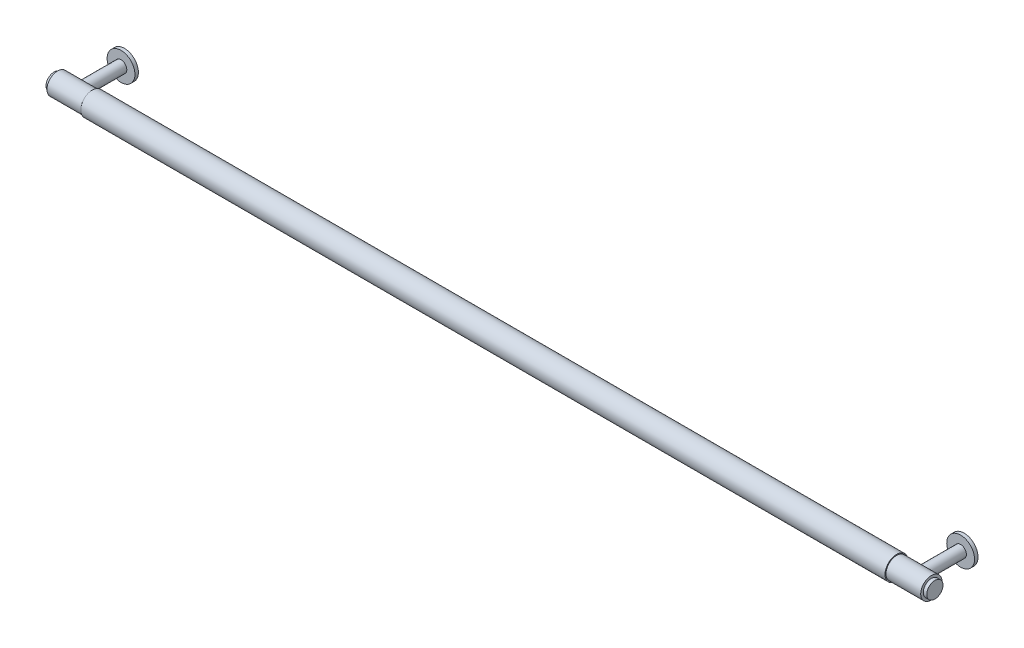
from build123d import *

# Parameters (mm, degrees)
SKETCH1_R            = 10
BOSS_EXTRUDE1_DEPTH  = 347
SKETCH2_R            = 9.2
BOSS_EXTRUDE3_DEPTH  = 30
SKETCH3_R            = 7
BOSS_EXTRUDE4_DEPTH  = 3
SKETCH4_R            = 5
BOSS_EXTRUDE5_DEPTH  = 40
SKETCH13_R           = 12
BOSS_EXTRUDE10_DEPTH = 3


with BuildPart() as part:
    # Sketch1 → Boss-Extrude1 (new body)
    with BuildSketch(Plane(origin=(0, 0, 0), x_dir=(0, 0, -1), z_dir=(1, 0, 0))):
        Circle(SKETCH1_R)
    boss_extrude1 = extrude(amount=BOSS_EXTRUDE1_DEPTH)

    # Sketch2 → Boss-Extrude3 (add)
    with BuildSketch(Plane(origin=(347, 0, 0), x_dir=(0, 0, -1), z_dir=(1, 0, 0))):
        Circle(SKETCH2_R)
    boss_extrude3 = extrude(amount=BOSS_EXTRUDE3_DEPTH)

    # Sketch3 → Boss-Extrude4 (add)
    with BuildSketch(Plane(origin=(377, 0, 0), x_dir=(0, 0, -1), z_dir=(1, 0, 0))):
        Circle(SKETCH3_R)
    boss_extrude4 = extrude(amount=BOSS_EXTRUDE4_DEPTH)

    # Mirror1: Boss-Extrude1, Boss-Extrude3, Boss-Extrude4 across plane
    add(boss_extrude1.mirror(Plane(origin=(0, 0, 0), x_dir=(0, 0, 1), z_dir=(1, 0, 0))))
    add(boss_extrude3.mirror(Plane(origin=(0, 0, 0), x_dir=(0, 0, 1), z_dir=(1, 0, 0))))
    add(boss_extrude4.mirror(Plane(origin=(0, 0, 0), x_dir=(0, 0, 1), z_dir=(1, 0, 0))))

    # Sketch4 → Boss-Extrude5 (add)
    with BuildSketch(Plane.XY):
        with Locations((-362.25, 0)):
            Circle(SKETCH4_R)
    boss_extrude5 = extrude(amount=-BOSS_EXTRUDE5_DEPTH)

    # Mirror2: Boss-Extrude5 across plane
    add(boss_extrude5.mirror(Plane(origin=(0, 0, 0), x_dir=(0, 0, 1), z_dir=(1, 0, 0))))

    # Sketch13 → Boss-Extrude10 (add)
    with BuildSketch(Plane(origin=(0, 0, -40), x_dir=(-1, 0, 0), z_dir=(0, 0, -1))):
        with Locations((-362.25, 0)):
            Circle(SKETCH13_R)
    boss_extrude10 = extrude(amount=BOSS_EXTRUDE10_DEPTH)

    # Mirror4: Boss-Extrude10 across plane
    add(boss_extrude10.mirror(Plane(origin=(0, 0, 0), x_dir=(0, 0, 1), z_dir=(1, 0, 0))))


solid = part.part
